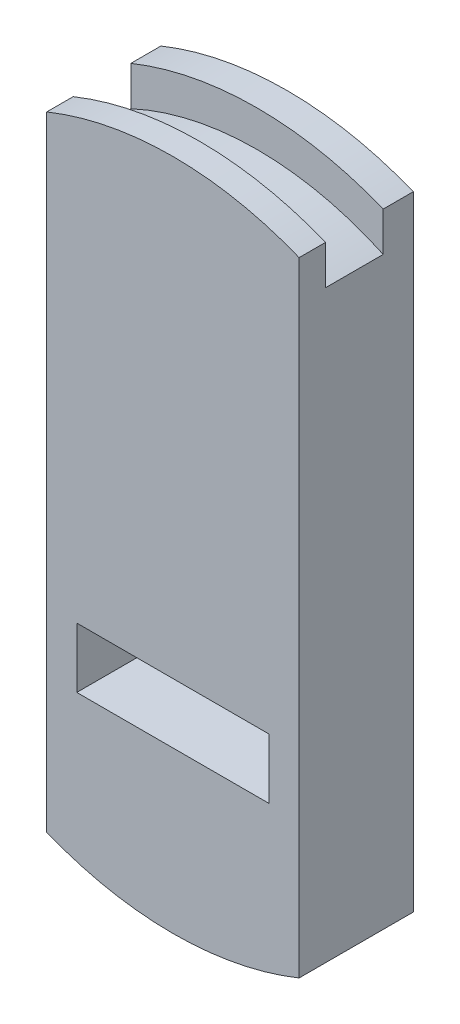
from build123d import *

# Parameters (mm, degrees)
SKETCH_1_R          = 25
EXTRUDE_2_DEPTH     = 9.8
CUT_EXTRUDE_1_DEPTH = 9.8
SKETCH_3_W          = 16
SKETCH_3_H          = 5
CUT_EXTRUDE_2_DEPTH = 10
EXTRUDE_START       = -2.5
SKETCH_4_R          = 28
SKETCH_4_R_2        = 25
EXTRUDE_3_DEPTH     = 2.5
SKETCH_5_R          = 28
SKETCH_5_R_2        = 25
EXTRUDE_4_DEPTH     = 2.5
CUT_EXTRUDE_3_DEPTH = 20
EXTRUDE_START_2     = -8
EXTRUDE_5_DEPTH     = 8
CUT_EXTRUDE_4_DEPTH = 15
SKETCH_9_W          = 11.284570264
SKETCH_9_H          = 62.816255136
CUT_EXTRUDE_5_DEPTH = 60


with BuildPart() as part:
    # Sketch 1 → Extrude 2 (new body)
    with BuildSketch(Plane.XY):
        Circle(SKETCH_1_R)
    extrude(amount=EXTRUDE_2_DEPTH)

    # Sketch 2 → Cut-Extrude 1 (cut)
    with BuildSketch(Plane.XY.offset(9.8)):
        with BuildLine():
            Line((-10.75, 29.767252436), (-10.75, -29.767252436))
            ThreePointArc((-10.75, -29.767252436), (-31.648883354, 0), (-10.75, 29.767252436))
        make_face()
        with BuildLine():
            Line((10.75, 29.767252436), (10.75, -29.767252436))
            ThreePointArc((10.75, -29.767252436), (31.648883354, 0), (10.75, 29.767252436))
        make_face()
    extrude(amount=-CUT_EXTRUDE_1_DEPTH, mode=Mode.SUBTRACT)

    # Sketch 3 → Cut-Extrude 2 (cut)
    with BuildSketch(Plane.XY.offset(9.8)):
        with Locations((0, -12.127429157)):
            Rectangle(SKETCH_3_W, SKETCH_3_H)
    extrude(amount=-CUT_EXTRUDE_2_DEPTH, mode=Mode.SUBTRACT)

    # Sketch 4 → Extrude 3 (add)
    with BuildSketch(Plane.XY.offset(9.8).offset(EXTRUDE_START)):
        Circle(SKETCH_4_R)
        Circle(SKETCH_4_R_2, mode=Mode.SUBTRACT)
    extrude(amount=EXTRUDE_3_DEPTH)

    # Sketch 5 → Extrude 4 (add)
    with BuildSketch(Plane(origin=(0, 0, 0), x_dir=(-1, 0, 0), z_dir=(0, 0, -1))):
        with Locations(Location((0, 0, 0), (0, 0, 180))):
            Circle(SKETCH_5_R)
        Circle(SKETCH_5_R_2, mode=Mode.SUBTRACT)
    extrude(amount=-EXTRUDE_4_DEPTH)

    # Sketch 6 → Cut-Extrude 3 (cut)
    with BuildSketch(Plane.XY.offset(9.8)):
        with BuildLine():
            Line((-10.75, 30.635873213), (-10.75, -30.635873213))
            ThreePointArc((-10.75, -30.635873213), (-32.467202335, 0), (-10.75, 30.635873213))
        make_face()
        with BuildLine():
            Line((10.75, 30.635873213), (10.75, -30.635873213))
            ThreePointArc((10.75, -30.635873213), (32.467202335, 0), (10.75, 30.635873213))
        make_face()
    extrude(amount=-CUT_EXTRUDE_3_DEPTH, mode=Mode.SUBTRACT)

    # Sketch 7 → Extrude 5 (add)
    with BuildSketch(Plane.XY.offset(9.8).offset(EXTRUDE_START_2)):
        with BuildLine():
            Line((10.75, -20.918415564), (10.75, -25.854158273))
            ThreePointArc((10.75, -25.854158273), (0, -28), (-10.75, -25.854158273))
            Line((-10.75, -25.854158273), (-10.75, -20.918415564))
            Line((-10.75, -20.918415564), (10.75, -20.918415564))
        make_face()
    extrude(amount=EXTRUDE_5_DEPTH)

    # Sketch 8 → Cut-Extrude 4 (cut)
    with BuildSketch(Plane.XY.offset(9.8)):
        with BuildLine():
            Line((-10.5, 33.08227656), (-10.5, -29.472146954))
            ThreePointArc((-10.5, -29.472146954), (-32.992635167, 1.805064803), (-10.5, 33.08227656))
        make_face()
        with BuildLine():
            Line((10.5, 33.08227656), (10.5, -29.472146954))
            ThreePointArc((10.5, -29.472146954), (32.992635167, 1.805064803), (10.5, 33.08227656))
        make_face()
    extrude(amount=-CUT_EXTRUDE_4_DEPTH, mode=Mode.SUBTRACT)

    # Sketch 9 → Cut-Extrude 5 (cut)
    with BuildSketch(Plane(origin=(10.5, 0, 0), x_dir=(0, 0, -1), z_dir=(1, 0, 0))):
        with Locations((-15.142285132, 0.481350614)):
            Rectangle(SKETCH_9_W, SKETCH_9_H)
    extrude(amount=-CUT_EXTRUDE_5_DEPTH, mode=Mode.SUBTRACT)


solid = part.part
